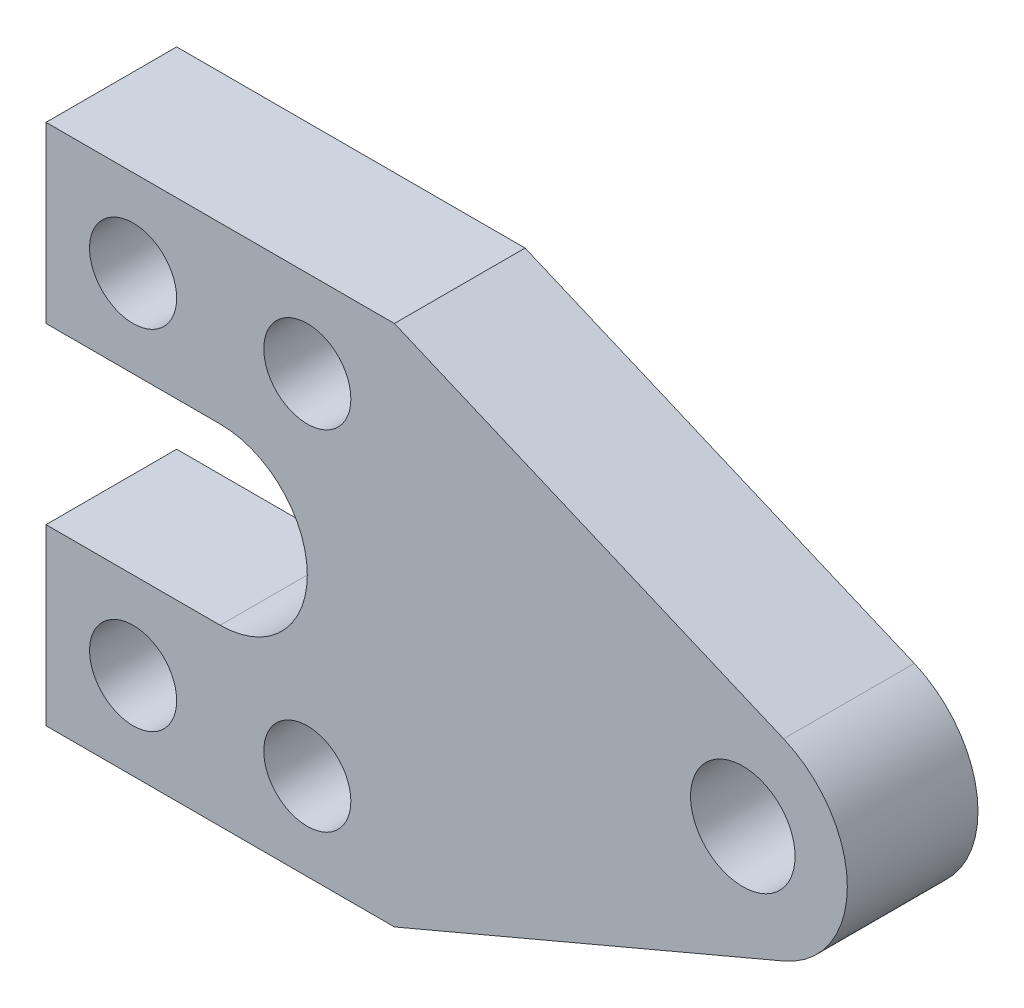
ISO-10303-21;
HEADER;
FILE_DESCRIPTION(('STEP AP214'),'2;1');
FILE_NAME('part.step','',(''),(''),'','','');
FILE_SCHEMA(('AUTOMOTIVE_DESIGN { 1 0 10303 214 1 1 1 1 }'));
ENDSEC;
DATA;
#1=APPLICATION_CONTEXT('core data for automotive mechanical design processes');
#2=APPLICATION_PROTOCOL_DEFINITION('international standard','automotive_design',2000,#1);
#3=PRODUCT_CONTEXT('',#1,'mechanical');
#4=PRODUCT('Part','Part','',(#3));
#5=PRODUCT_RELATED_PRODUCT_CATEGORY('part','',(#4));
#6=PRODUCT_DEFINITION_FORMATION('','',#4);
#7=PRODUCT_DEFINITION_CONTEXT('part definition',#1,'design');
#8=PRODUCT_DEFINITION('design','',#6,#7);
#9=PRODUCT_DEFINITION_SHAPE('','',#8);
#10=(LENGTH_UNIT() NAMED_UNIT(*) SI_UNIT(.MILLI.,.METRE.));
#11=(NAMED_UNIT(*) PLANE_ANGLE_UNIT() SI_UNIT($,.RADIAN.));
#12=(NAMED_UNIT(*) SI_UNIT($,.STERADIAN.) SOLID_ANGLE_UNIT());
#13=UNCERTAINTY_MEASURE_WITH_UNIT(LENGTH_MEASURE(1.E-05),#10,'distance_accuracy_value','');
#14=(GEOMETRIC_REPRESENTATION_CONTEXT(3) GLOBAL_UNCERTAINTY_ASSIGNED_CONTEXT((#13)) GLOBAL_UNIT_ASSIGNED_CONTEXT((#10,
#11,#12)) REPRESENTATION_CONTEXT('',''));
#15=CARTESIAN_POINT('',(0.,0.,0.));
#16=DIRECTION('',(0.,0.,1.));
#17=DIRECTION('',(1.,0.,0.));
#18=AXIS2_PLACEMENT_3D('',#15,#16,#17);
#19=CARTESIAN_POINT('',(90.,40.,15.));
#20=DIRECTION('',(0.,0.,-1.));
#21=DIRECTION('',(-1.,0.,0.));
#22=AXIS2_PLACEMENT_3D('',#19,#20,#21);
#23=PLANE('',#22);
#24=CARTESIAN_POINT('',(20.,60.,15.));
#25=DIRECTION('',(0.,0.,1.));
#26=DIRECTION('',(1.,0.,0.));
#27=AXIS2_PLACEMENT_3D('',#24,#25,#26);
#28=CIRCLE('',#27,5.);
#29=CARTESIAN_POINT('',(25.,60.,15.));
#30=VERTEX_POINT('',#29);
#31=EDGE_CURVE('E269',#30,#30,#28,.T.);
#32=ORIENTED_EDGE('',*,*,#31,.F.);
#33=EDGE_LOOP('',(#32));
#34=FACE_BOUND('',#33,.T.);
#35=CARTESIAN_POINT('',(20.,20.,15.));
#36=DIRECTION('',(0.,0.,1.));
#37=DIRECTION('',(1.,0.,0.));
#38=AXIS2_PLACEMENT_3D('',#35,#36,#37);
#39=CIRCLE('',#38,5.);
#40=CARTESIAN_POINT('',(25.,20.,15.));
#41=VERTEX_POINT('',#40);
#42=EDGE_CURVE('E270',#41,#41,#39,.T.);
#43=ORIENTED_EDGE('',*,*,#42,.F.);
#44=EDGE_LOOP('',(#43));
#45=FACE_BOUND('',#44,.T.);
#46=DIRECTION('',(0.,-1.,0.));
#47=VECTOR('',#46,1.);
#48=CARTESIAN_POINT('',(10.,50.,15.));
#49=LINE('',#48,#47);
#50=CARTESIAN_POINT('',(9.99999999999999,70.,15.));
#51=VERTEX_POINT('',#50);
#52=CARTESIAN_POINT('',(10.,50.,15.));
#53=VERTEX_POINT('',#52);
#54=EDGE_CURVE('E163',#51,#53,#49,.T.);
#55=ORIENTED_EDGE('',*,*,#54,.T.);
#56=DIRECTION('',(1.,0.,0.));
#57=VECTOR('',#56,1.);
#58=CARTESIAN_POINT('',(10.,50.,15.));
#59=LINE('',#58,#57);
#60=CARTESIAN_POINT('',(30.,50.,15.));
#61=VERTEX_POINT('',#60);
#62=EDGE_CURVE('E101',#53,#61,#59,.T.);
#63=ORIENTED_EDGE('',*,*,#62,.T.);
#64=CARTESIAN_POINT('',(30.,40.,15.));
#65=DIRECTION('',(0.,0.,-1.));
#66=DIRECTION('',(1.,0.,0.));
#67=AXIS2_PLACEMENT_3D('',#64,#65,#66);
#68=CIRCLE('',#67,10.);
#69=CARTESIAN_POINT('',(30.,30.,15.));
#70=VERTEX_POINT('',#69);
#71=EDGE_CURVE('E286',#61,#70,#68,.T.);
#72=ORIENTED_EDGE('',*,*,#71,.T.);
#73=DIRECTION('',(-1.,0.,0.));
#74=VECTOR('',#73,1.);
#75=CARTESIAN_POINT('',(10.,30.,15.));
#76=LINE('',#75,#74);
#77=CARTESIAN_POINT('',(10.,30.,15.));
#78=VERTEX_POINT('',#77);
#79=EDGE_CURVE('E288',#70,#78,#76,.T.);
#80=ORIENTED_EDGE('',*,*,#79,.T.);
#81=DIRECTION('',(0.,-1.,0.));
#82=VECTOR('',#81,1.);
#83=CARTESIAN_POINT('',(9.99999999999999,9.99999999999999,15.));
#84=LINE('',#83,#82);
#85=CARTESIAN_POINT('',(9.99999999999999,9.99999999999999,15.));
#86=VERTEX_POINT('',#85);
#87=EDGE_CURVE('E290',#78,#86,#84,.T.);
#88=ORIENTED_EDGE('',*,*,#87,.T.);
#89=DIRECTION('',(1.,0.,0.));
#90=VECTOR('',#89,1.);
#91=CARTESIAN_POINT('',(50.,9.99999999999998,15.));
#92=LINE('',#91,#90);
#93=CARTESIAN_POINT('',(50.,9.99999999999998,15.));
#94=VERTEX_POINT('',#93);
#95=EDGE_CURVE('E292',#86,#94,#92,.T.);
#96=ORIENTED_EDGE('',*,*,#95,.T.);
#97=DIRECTION('',(0.920618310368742,0.390463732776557,0.));
#98=VECTOR('',#97,1.);
#99=CARTESIAN_POINT('',(94.6855647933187,28.9525802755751,15.));
#100=LINE('',#99,#98);
#101=CARTESIAN_POINT('',(94.6855647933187,28.9525802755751,15.));
#102=VERTEX_POINT('',#101);
#103=EDGE_CURVE('E126',#94,#102,#100,.T.);
#104=ORIENTED_EDGE('',*,*,#103,.T.);
#105=CARTESIAN_POINT('',(90.,40.,15.));
#106=DIRECTION('',(0.,0.,1.));
#107=DIRECTION('',(-1.,0.,0.));
#108=AXIS2_PLACEMENT_3D('',#105,#106,#107);
#109=CIRCLE('',#108,12.);
#110=CARTESIAN_POINT('',(94.6855647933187,51.0474197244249,15.));
#111=VERTEX_POINT('',#110);
#112=EDGE_CURVE('E120',#102,#111,#109,.T.);
#113=ORIENTED_EDGE('',*,*,#112,.T.);
#114=DIRECTION('',(-0.920618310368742,0.390463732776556,0.));
#115=VECTOR('',#114,1.);
#116=CARTESIAN_POINT('',(50.,70.,15.));
#117=LINE('',#116,#115);
#118=CARTESIAN_POINT('',(50.,70.,15.));
#119=VERTEX_POINT('',#118);
#120=EDGE_CURVE('E124',#111,#119,#117,.T.);
#121=ORIENTED_EDGE('',*,*,#120,.T.);
#122=DIRECTION('',(-1.,0.,0.));
#123=VECTOR('',#122,1.);
#124=CARTESIAN_POINT('',(9.99999999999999,70.,15.));
#125=LINE('',#124,#123);
#126=EDGE_CURVE('E51',#119,#51,#125,.T.);
#127=ORIENTED_EDGE('',*,*,#126,.T.);
#128=EDGE_LOOP('',(#55,#63,#72,#80,#88,#96,#104,#113,#121,#127));
#129=FACE_BOUND('',#128,.T.);
#130=CARTESIAN_POINT('',(90.,40.,15.));
#131=DIRECTION('',(0.,0.,1.));
#132=DIRECTION('',(1.,0.,0.));
#133=AXIS2_PLACEMENT_3D('',#130,#131,#132);
#134=CIRCLE('',#133,6.);
#135=CARTESIAN_POINT('',(96.,40.,15.));
#136=VERTEX_POINT('',#135);
#137=EDGE_CURVE('E148',#136,#136,#134,.T.);
#138=ORIENTED_EDGE('',*,*,#137,.F.);
#139=EDGE_LOOP('',(#138));
#140=FACE_BOUND('',#139,.T.);
#141=CARTESIAN_POINT('',(40.,20.,15.));
#142=DIRECTION('',(0.,0.,1.));
#143=DIRECTION('',(1.,0.,0.));
#144=AXIS2_PLACEMENT_3D('',#141,#142,#143);
#145=CIRCLE('',#144,5.);
#146=CARTESIAN_POINT('',(45.,20.,15.));
#147=VERTEX_POINT('',#146);
#148=EDGE_CURVE('E187',#147,#147,#145,.T.);
#149=ORIENTED_EDGE('',*,*,#148,.F.);
#150=EDGE_LOOP('',(#149));
#151=FACE_BOUND('',#150,.T.);
#152=CARTESIAN_POINT('',(40.,60.,15.));
#153=DIRECTION('',(0.,0.,1.));
#154=DIRECTION('',(1.,0.,0.));
#155=AXIS2_PLACEMENT_3D('',#152,#153,#154);
#156=CIRCLE('',#155,5.);
#157=CARTESIAN_POINT('',(45.,60.,15.));
#158=VERTEX_POINT('',#157);
#159=EDGE_CURVE('E11',#158,#158,#156,.T.);
#160=ORIENTED_EDGE('',*,*,#159,.F.);
#161=EDGE_LOOP('',(#160));
#162=FACE_BOUND('',#161,.T.);
#163=ADVANCED_FACE('F34',(#34,#45,#129,#140,#151,#162),#23,.F.);
#164=CARTESIAN_POINT('',(90.,40.,0.));
#165=DIRECTION('',(0.,0.,-1.));
#166=DIRECTION('',(-1.,0.,0.));
#167=AXIS2_PLACEMENT_3D('',#164,#165,#166);
#168=PLANE('',#167);
#169=CARTESIAN_POINT('',(20.,60.,0.));
#170=DIRECTION('',(0.,0.,1.));
#171=DIRECTION('',(1.,0.,0.));
#172=AXIS2_PLACEMENT_3D('',#169,#170,#171);
#173=CIRCLE('',#172,5.);
#174=CARTESIAN_POINT('',(25.,60.,0.));
#175=VERTEX_POINT('',#174);
#176=EDGE_CURVE('E267',#175,#175,#173,.T.);
#177=ORIENTED_EDGE('',*,*,#176,.T.);
#178=EDGE_LOOP('',(#177));
#179=FACE_BOUND('',#178,.T.);
#180=CARTESIAN_POINT('',(20.,20.,0.));
#181=DIRECTION('',(0.,0.,1.));
#182=DIRECTION('',(1.,0.,0.));
#183=AXIS2_PLACEMENT_3D('',#180,#181,#182);
#184=CIRCLE('',#183,5.);
#185=CARTESIAN_POINT('',(25.,20.,0.));
#186=VERTEX_POINT('',#185);
#187=EDGE_CURVE('E273',#186,#186,#184,.T.);
#188=ORIENTED_EDGE('',*,*,#187,.T.);
#189=EDGE_LOOP('',(#188));
#190=FACE_BOUND('',#189,.T.);
#191=DIRECTION('',(0.,-1.,0.));
#192=VECTOR('',#191,1.);
#193=CARTESIAN_POINT('',(10.,50.,0.));
#194=LINE('',#193,#192);
#195=CARTESIAN_POINT('',(9.99999999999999,70.,0.));
#196=VERTEX_POINT('',#195);
#197=CARTESIAN_POINT('',(10.,50.,0.));
#198=VERTEX_POINT('',#197);
#199=EDGE_CURVE('E144',#196,#198,#194,.T.);
#200=ORIENTED_EDGE('',*,*,#199,.F.);
#201=DIRECTION('',(-1.,0.,0.));
#202=VECTOR('',#201,1.);
#203=CARTESIAN_POINT('',(9.99999999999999,70.,0.));
#204=LINE('',#203,#202);
#205=CARTESIAN_POINT('',(50.,70.,0.));
#206=VERTEX_POINT('',#205);
#207=EDGE_CURVE('E92',#206,#196,#204,.T.);
#208=ORIENTED_EDGE('',*,*,#207,.F.);
#209=DIRECTION('',(-0.920618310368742,0.390463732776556,0.));
#210=VECTOR('',#209,1.);
#211=CARTESIAN_POINT('',(50.,70.,0.));
#212=LINE('',#211,#210);
#213=CARTESIAN_POINT('',(94.6855647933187,51.0474197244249,0.));
#214=VERTEX_POINT('',#213);
#215=EDGE_CURVE('E86',#214,#206,#212,.T.);
#216=ORIENTED_EDGE('',*,*,#215,.F.);
#217=CARTESIAN_POINT('',(90.,40.,0.));
#218=DIRECTION('',(0.,0.,1.));
#219=DIRECTION('',(-1.,0.,0.));
#220=AXIS2_PLACEMENT_3D('',#217,#218,#219);
#221=CIRCLE('',#220,12.);
#222=CARTESIAN_POINT('',(94.6855647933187,28.9525802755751,0.));
#223=VERTEX_POINT('',#222);
#224=EDGE_CURVE('E134',#223,#214,#221,.T.);
#225=ORIENTED_EDGE('',*,*,#224,.F.);
#226=DIRECTION('',(0.920618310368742,0.390463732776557,0.));
#227=VECTOR('',#226,1.);
#228=CARTESIAN_POINT('',(94.6855647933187,28.9525802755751,0.));
#229=LINE('',#228,#227);
#230=CARTESIAN_POINT('',(50.,9.99999999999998,0.));
#231=VERTEX_POINT('',#230);
#232=EDGE_CURVE('E158',#231,#223,#229,.T.);
#233=ORIENTED_EDGE('',*,*,#232,.F.);
#234=DIRECTION('',(1.,0.,0.));
#235=VECTOR('',#234,1.);
#236=CARTESIAN_POINT('',(50.,9.99999999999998,0.));
#237=LINE('',#236,#235);
#238=CARTESIAN_POINT('',(9.99999999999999,9.99999999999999,0.));
#239=VERTEX_POINT('',#238);
#240=EDGE_CURVE('E156',#239,#231,#237,.T.);
#241=ORIENTED_EDGE('',*,*,#240,.F.);
#242=DIRECTION('',(0.,-1.,0.));
#243=VECTOR('',#242,1.);
#244=CARTESIAN_POINT('',(9.99999999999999,9.99999999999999,0.));
#245=LINE('',#244,#243);
#246=CARTESIAN_POINT('',(10.,30.,0.));
#247=VERTEX_POINT('',#246);
#248=EDGE_CURVE('E154',#247,#239,#245,.T.);
#249=ORIENTED_EDGE('',*,*,#248,.F.);
#250=DIRECTION('',(-1.,0.,0.));
#251=VECTOR('',#250,1.);
#252=CARTESIAN_POINT('',(10.,30.,0.));
#253=LINE('',#252,#251);
#254=CARTESIAN_POINT('',(30.,30.,0.));
#255=VERTEX_POINT('',#254);
#256=EDGE_CURVE('E152',#255,#247,#253,.T.);
#257=ORIENTED_EDGE('',*,*,#256,.F.);
#258=CARTESIAN_POINT('',(30.,40.,0.));
#259=DIRECTION('',(0.,0.,-1.));
#260=DIRECTION('',(1.,0.,0.));
#261=AXIS2_PLACEMENT_3D('',#258,#259,#260);
#262=CIRCLE('',#261,10.);
#263=CARTESIAN_POINT('',(30.,50.,0.));
#264=VERTEX_POINT('',#263);
#265=EDGE_CURVE('E150',#264,#255,#262,.T.);
#266=ORIENTED_EDGE('',*,*,#265,.F.);
#267=DIRECTION('',(1.,0.,0.));
#268=VECTOR('',#267,1.);
#269=CARTESIAN_POINT('',(10.,50.,0.));
#270=LINE('',#269,#268);
#271=EDGE_CURVE('E147',#198,#264,#270,.T.);
#272=ORIENTED_EDGE('',*,*,#271,.F.);
#273=EDGE_LOOP('',(#200,#208,#216,#225,#233,#241,#249,#257,#266,#272));
#274=FACE_BOUND('',#273,.T.);
#275=CARTESIAN_POINT('',(90.,40.,0.));
#276=DIRECTION('',(0.,0.,1.));
#277=DIRECTION('',(1.,0.,0.));
#278=AXIS2_PLACEMENT_3D('',#275,#276,#277);
#279=CIRCLE('',#278,6.);
#280=CARTESIAN_POINT('',(96.,40.,0.));
#281=VERTEX_POINT('',#280);
#282=EDGE_CURVE('E278',#281,#281,#279,.T.);
#283=ORIENTED_EDGE('',*,*,#282,.T.);
#284=EDGE_LOOP('',(#283));
#285=FACE_BOUND('',#284,.T.);
#286=CARTESIAN_POINT('',(40.,20.,0.));
#287=DIRECTION('',(0.,0.,1.));
#288=DIRECTION('',(1.,0.,0.));
#289=AXIS2_PLACEMENT_3D('',#286,#287,#288);
#290=CIRCLE('',#289,5.);
#291=CARTESIAN_POINT('',(45.,20.,0.));
#292=VERTEX_POINT('',#291);
#293=EDGE_CURVE('E184',#292,#292,#290,.T.);
#294=ORIENTED_EDGE('',*,*,#293,.T.);
#295=EDGE_LOOP('',(#294));
#296=FACE_BOUND('',#295,.T.);
#297=CARTESIAN_POINT('',(40.,60.,0.));
#298=DIRECTION('',(0.,0.,1.));
#299=DIRECTION('',(1.,0.,0.));
#300=AXIS2_PLACEMENT_3D('',#297,#298,#299);
#301=CIRCLE('',#300,5.);
#302=CARTESIAN_POINT('',(45.,60.,0.));
#303=VERTEX_POINT('',#302);
#304=EDGE_CURVE('E43',#303,#303,#301,.T.);
#305=ORIENTED_EDGE('',*,*,#304,.T.);
#306=EDGE_LOOP('',(#305));
#307=FACE_BOUND('',#306,.T.);
#308=ADVANCED_FACE('F192',(#179,#190,#274,#285,#296,#307),#168,.T.);
#309=CARTESIAN_POINT('',(10.,50.,15.));
#310=DIRECTION('',(1.,0.,0.));
#311=DIRECTION('',(0.,1.,0.));
#312=AXIS2_PLACEMENT_3D('',#309,#310,#311);
#313=PLANE('',#312);
#314=ORIENTED_EDGE('',*,*,#199,.T.);
#315=DIRECTION('',(0.,0.,-1.));
#316=VECTOR('',#315,1.);
#317=CARTESIAN_POINT('',(10.,50.,15.));
#318=LINE('',#317,#316);
#319=EDGE_CURVE('E182',#53,#198,#318,.T.);
#320=ORIENTED_EDGE('',*,*,#319,.F.);
#321=ORIENTED_EDGE('',*,*,#54,.F.);
#322=DIRECTION('',(0.,0.,-1.));
#323=VECTOR('',#322,1.);
#324=CARTESIAN_POINT('',(9.99999999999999,70.,15.));
#325=LINE('',#324,#323);
#326=EDGE_CURVE('E140',#51,#196,#325,.T.);
#327=ORIENTED_EDGE('',*,*,#326,.T.);
#328=EDGE_LOOP('',(#314,#320,#321,#327));
#329=FACE_BOUND('',#328,.T.);
#330=ADVANCED_FACE('F205',(#329),#313,.F.);
#331=CARTESIAN_POINT('',(10.,50.,15.));
#332=DIRECTION('',(0.,1.,0.));
#333=DIRECTION('',(0.,0.,1.));
#334=AXIS2_PLACEMENT_3D('',#331,#332,#333);
#335=PLANE('',#334);
#336=ORIENTED_EDGE('',*,*,#271,.T.);
#337=DIRECTION('',(0.,0.,-1.));
#338=VECTOR('',#337,1.);
#339=CARTESIAN_POINT('',(30.,50.,15.));
#340=LINE('',#339,#338);
#341=EDGE_CURVE('E179',#61,#264,#340,.T.);
#342=ORIENTED_EDGE('',*,*,#341,.F.);
#343=ORIENTED_EDGE('',*,*,#62,.F.);
#344=ORIENTED_EDGE('',*,*,#319,.T.);
#345=EDGE_LOOP('',(#336,#342,#343,#344));
#346=FACE_BOUND('',#345,.T.);
#347=ADVANCED_FACE('F240',(#346),#335,.F.);
#348=CARTESIAN_POINT('',(30.,40.,15.));
#349=DIRECTION('',(0.,0.,-1.));
#350=DIRECTION('',(-1.,0.,0.));
#351=AXIS2_PLACEMENT_3D('',#348,#349,#350);
#352=CYLINDRICAL_SURFACE('',#351,10.);
#353=ORIENTED_EDGE('',*,*,#265,.T.);
#354=DIRECTION('',(0.,0.,-1.));
#355=VECTOR('',#354,1.);
#356=CARTESIAN_POINT('',(30.,30.,15.));
#357=LINE('',#356,#355);
#358=EDGE_CURVE('E176',#70,#255,#357,.T.);
#359=ORIENTED_EDGE('',*,*,#358,.F.);
#360=ORIENTED_EDGE('',*,*,#71,.F.);
#361=ORIENTED_EDGE('',*,*,#341,.T.);
#362=EDGE_LOOP('',(#353,#359,#360,#361));
#363=FACE_BOUND('',#362,.T.);
#364=ADVANCED_FACE('F236',(#363),#352,.F.);
#365=CARTESIAN_POINT('',(10.,30.,15.));
#366=DIRECTION('',(0.,-1.,0.));
#367=DIRECTION('',(0.,0.,-1.));
#368=AXIS2_PLACEMENT_3D('',#365,#366,#367);
#369=PLANE('',#368);
#370=ORIENTED_EDGE('',*,*,#256,.T.);
#371=DIRECTION('',(0.,0.,-1.));
#372=VECTOR('',#371,1.);
#373=CARTESIAN_POINT('',(10.,30.,15.));
#374=LINE('',#373,#372);
#375=EDGE_CURVE('E173',#78,#247,#374,.T.);
#376=ORIENTED_EDGE('',*,*,#375,.F.);
#377=ORIENTED_EDGE('',*,*,#79,.F.);
#378=ORIENTED_EDGE('',*,*,#358,.T.);
#379=EDGE_LOOP('',(#370,#376,#377,#378));
#380=FACE_BOUND('',#379,.T.);
#381=ADVANCED_FACE('F232',(#380),#369,.F.);
#382=CARTESIAN_POINT('',(9.99999999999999,9.99999999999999,15.));
#383=DIRECTION('',(1.,0.,0.));
#384=DIRECTION('',(0.,1.,0.));
#385=AXIS2_PLACEMENT_3D('',#382,#383,#384);
#386=PLANE('',#385);
#387=ORIENTED_EDGE('',*,*,#248,.T.);
#388=DIRECTION('',(0.,0.,-1.));
#389=VECTOR('',#388,1.);
#390=CARTESIAN_POINT('',(9.99999999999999,9.99999999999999,15.));
#391=LINE('',#390,#389);
#392=EDGE_CURVE('E170',#86,#239,#391,.T.);
#393=ORIENTED_EDGE('',*,*,#392,.F.);
#394=ORIENTED_EDGE('',*,*,#87,.F.);
#395=ORIENTED_EDGE('',*,*,#375,.T.);
#396=EDGE_LOOP('',(#387,#393,#394,#395));
#397=FACE_BOUND('',#396,.T.);
#398=ADVANCED_FACE('F228',(#397),#386,.F.);
#399=CARTESIAN_POINT('',(50.,9.99999999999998,15.));
#400=DIRECTION('',(0.,1.,0.));
#401=DIRECTION('',(-1.,0.,0.));
#402=AXIS2_PLACEMENT_3D('',#399,#400,#401);
#403=PLANE('',#402);
#404=ORIENTED_EDGE('',*,*,#240,.T.);
#405=DIRECTION('',(0.,0.,-1.));
#406=VECTOR('',#405,1.);
#407=CARTESIAN_POINT('',(50.,9.99999999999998,15.));
#408=LINE('',#407,#406);
#409=EDGE_CURVE('E167',#94,#231,#408,.T.);
#410=ORIENTED_EDGE('',*,*,#409,.F.);
#411=ORIENTED_EDGE('',*,*,#95,.F.);
#412=ORIENTED_EDGE('',*,*,#392,.T.);
#413=EDGE_LOOP('',(#404,#410,#411,#412));
#414=FACE_BOUND('',#413,.T.);
#415=ADVANCED_FACE('F224',(#414),#403,.F.);
#416=CARTESIAN_POINT('',(94.6855647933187,28.9525802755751,15.));
#417=DIRECTION('',(-0.390463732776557,0.920618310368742,0.));
#418=DIRECTION('',(-0.920618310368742,-0.390463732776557,0.));
#419=AXIS2_PLACEMENT_3D('',#416,#417,#418);
#420=PLANE('',#419);
#421=ORIENTED_EDGE('',*,*,#232,.T.);
#422=DIRECTION('',(0.,0.,-1.));
#423=VECTOR('',#422,1.);
#424=CARTESIAN_POINT('',(94.6855647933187,28.9525802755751,15.));
#425=LINE('',#424,#423);
#426=EDGE_CURVE('E135',#102,#223,#425,.T.);
#427=ORIENTED_EDGE('',*,*,#426,.F.);
#428=ORIENTED_EDGE('',*,*,#103,.F.);
#429=ORIENTED_EDGE('',*,*,#409,.T.);
#430=EDGE_LOOP('',(#421,#427,#428,#429));
#431=FACE_BOUND('',#430,.T.);
#432=ADVANCED_FACE('F221',(#431),#420,.F.);
#433=CARTESIAN_POINT('',(90.,40.,15.));
#434=DIRECTION('',(0.,0.,-1.));
#435=DIRECTION('',(-1.,0.,0.));
#436=AXIS2_PLACEMENT_3D('',#433,#434,#435);
#437=CYLINDRICAL_SURFACE('',#436,12.);
#438=ORIENTED_EDGE('',*,*,#224,.T.);
#439=DIRECTION('',(0.,0.,-1.));
#440=VECTOR('',#439,1.);
#441=CARTESIAN_POINT('',(94.6855647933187,51.0474197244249,15.));
#442=LINE('',#441,#440);
#443=EDGE_CURVE('E131',#111,#214,#442,.T.);
#444=ORIENTED_EDGE('',*,*,#443,.F.);
#445=ORIENTED_EDGE('',*,*,#112,.F.);
#446=ORIENTED_EDGE('',*,*,#426,.T.);
#447=EDGE_LOOP('',(#438,#444,#445,#446));
#448=FACE_BOUND('',#447,.T.);
#449=ADVANCED_FACE('F132',(#448),#437,.T.);
#450=CARTESIAN_POINT('',(50.,70.,15.));
#451=DIRECTION('',(-0.390463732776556,-0.920618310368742,0.));
#452=DIRECTION('',(0.920618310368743,-0.390463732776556,0.));
#453=AXIS2_PLACEMENT_3D('',#450,#451,#452);
#454=PLANE('',#453);
#455=ORIENTED_EDGE('',*,*,#215,.T.);
#456=DIRECTION('',(0.,0.,-1.));
#457=VECTOR('',#456,1.);
#458=CARTESIAN_POINT('',(50.,70.,15.));
#459=LINE('',#458,#457);
#460=EDGE_CURVE('E136',#119,#206,#459,.T.);
#461=ORIENTED_EDGE('',*,*,#460,.F.);
#462=ORIENTED_EDGE('',*,*,#120,.F.);
#463=ORIENTED_EDGE('',*,*,#443,.T.);
#464=EDGE_LOOP('',(#455,#461,#462,#463));
#465=FACE_BOUND('',#464,.T.);
#466=ADVANCED_FACE('F138',(#465),#454,.F.);
#467=CARTESIAN_POINT('',(9.99999999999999,70.,15.));
#468=DIRECTION('',(0.,-1.,0.));
#469=DIRECTION('',(1.,0.,0.));
#470=AXIS2_PLACEMENT_3D('',#467,#468,#469);
#471=PLANE('',#470);
#472=ORIENTED_EDGE('',*,*,#207,.T.);
#473=ORIENTED_EDGE('',*,*,#326,.F.);
#474=ORIENTED_EDGE('',*,*,#126,.F.);
#475=ORIENTED_EDGE('',*,*,#460,.T.);
#476=EDGE_LOOP('',(#472,#473,#474,#475));
#477=FACE_BOUND('',#476,.T.);
#478=ADVANCED_FACE('F214',(#477),#471,.F.);
#479=CARTESIAN_POINT('',(90.,40.,15.));
#480=DIRECTION('',(0.,0.,-1.));
#481=DIRECTION('',(-1.,0.,0.));
#482=AXIS2_PLACEMENT_3D('',#479,#480,#481);
#483=CYLINDRICAL_SURFACE('',#482,6.);
#484=ORIENTED_EDGE('',*,*,#137,.T.);
#485=EDGE_LOOP('',(#484));
#486=FACE_BOUND('',#485,.T.);
#487=ORIENTED_EDGE('',*,*,#282,.F.);
#488=EDGE_LOOP('',(#487));
#489=FACE_BOUND('',#488,.T.);
#490=ADVANCED_FACE('F211',(#486,#489),#483,.F.);
#491=CARTESIAN_POINT('',(20.,20.,0.));
#492=DIRECTION('',(0.,0.,1.));
#493=DIRECTION('',(1.,0.,0.));
#494=AXIS2_PLACEMENT_3D('',#491,#492,#493);
#495=CYLINDRICAL_SURFACE('',#494,5.);
#496=ORIENTED_EDGE('',*,*,#187,.F.);
#497=EDGE_LOOP('',(#496));
#498=FACE_BOUND('',#497,.T.);
#499=ORIENTED_EDGE('',*,*,#42,.T.);
#500=EDGE_LOOP('',(#499));
#501=FACE_BOUND('',#500,.T.);
#502=ADVANCED_FACE('F252',(#498,#501),#495,.F.);
#503=CARTESIAN_POINT('',(20.,60.,0.));
#504=DIRECTION('',(0.,0.,1.));
#505=DIRECTION('',(1.,0.,0.));
#506=AXIS2_PLACEMENT_3D('',#503,#504,#505);
#507=CYLINDRICAL_SURFACE('',#506,5.);
#508=ORIENTED_EDGE('',*,*,#176,.F.);
#509=EDGE_LOOP('',(#508));
#510=FACE_BOUND('',#509,.T.);
#511=ORIENTED_EDGE('',*,*,#31,.T.);
#512=EDGE_LOOP('',(#511));
#513=FACE_BOUND('',#512,.T.);
#514=ADVANCED_FACE('F247',(#510,#513),#507,.F.);
#515=CARTESIAN_POINT('',(40.,20.,0.));
#516=DIRECTION('',(0.,0.,1.));
#517=DIRECTION('',(1.,0.,0.));
#518=AXIS2_PLACEMENT_3D('',#515,#516,#517);
#519=CYLINDRICAL_SURFACE('',#518,5.);
#520=ORIENTED_EDGE('',*,*,#293,.F.);
#521=EDGE_LOOP('',(#520));
#522=FACE_BOUND('',#521,.T.);
#523=ORIENTED_EDGE('',*,*,#148,.T.);
#524=EDGE_LOOP('',(#523));
#525=FACE_BOUND('',#524,.T.);
#526=ADVANCED_FACE('F196',(#522,#525),#519,.F.);
#527=CARTESIAN_POINT('',(40.,60.,0.));
#528=DIRECTION('',(0.,0.,1.));
#529=DIRECTION('',(1.,0.,0.));
#530=AXIS2_PLACEMENT_3D('',#527,#528,#529);
#531=CYLINDRICAL_SURFACE('',#530,5.);
#532=ORIENTED_EDGE('',*,*,#304,.F.);
#533=EDGE_LOOP('',(#532));
#534=FACE_BOUND('',#533,.T.);
#535=ORIENTED_EDGE('',*,*,#159,.T.);
#536=EDGE_LOOP('',(#535));
#537=FACE_BOUND('',#536,.T.);
#538=ADVANCED_FACE('F36',(#534,#537),#531,.F.);
#539=CLOSED_SHELL('',(#163,#308,#330,#347,#364,#381,#398,#415,#432,#449,#466,#478,#490,#502,
#514,#526,#538));
#540=MANIFOLD_SOLID_BREP('B2',#539);
#541=ADVANCED_BREP_SHAPE_REPRESENTATION('',(#18,#540),#14);
#542=SHAPE_DEFINITION_REPRESENTATION(#9,#541);
ENDSEC;
END-ISO-10303-21;
